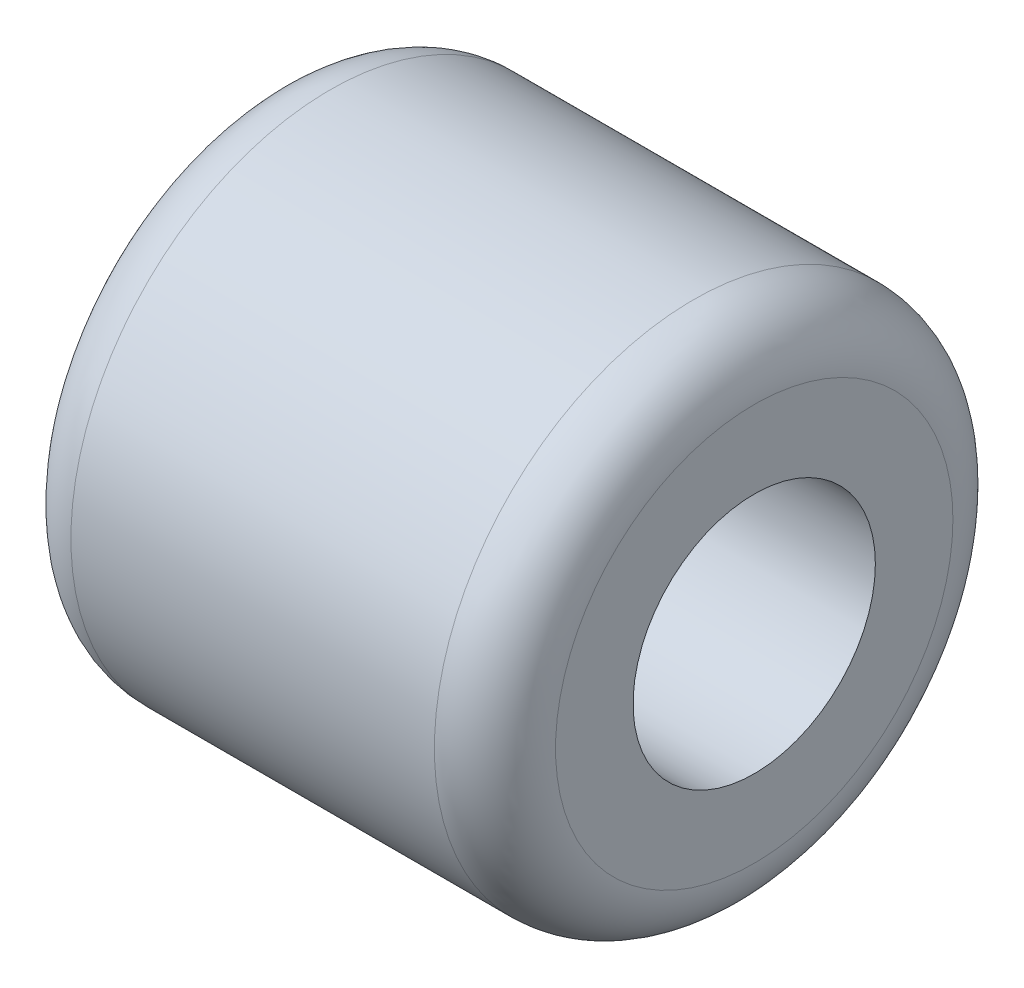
ISO-10303-21;
HEADER;
FILE_DESCRIPTION(('STEP AP214'),'2;1');
FILE_NAME('part.step','',(''),(''),'','','');
FILE_SCHEMA(('AUTOMOTIVE_DESIGN { 1 0 10303 214 1 1 1 1 }'));
ENDSEC;
DATA;
#1=APPLICATION_CONTEXT('core data for automotive mechanical design processes');
#2=APPLICATION_PROTOCOL_DEFINITION('international standard','automotive_design',2000,#1);
#3=PRODUCT_CONTEXT('',#1,'mechanical');
#4=PRODUCT('Part','Part','',(#3));
#5=PRODUCT_RELATED_PRODUCT_CATEGORY('part','',(#4));
#6=PRODUCT_DEFINITION_FORMATION('','',#4);
#7=PRODUCT_DEFINITION_CONTEXT('part definition',#1,'design');
#8=PRODUCT_DEFINITION('design','',#6,#7);
#9=PRODUCT_DEFINITION_SHAPE('','',#8);
#10=(LENGTH_UNIT() NAMED_UNIT(*) SI_UNIT(.MILLI.,.METRE.));
#11=(NAMED_UNIT(*) PLANE_ANGLE_UNIT() SI_UNIT($,.RADIAN.));
#12=(NAMED_UNIT(*) SI_UNIT($,.STERADIAN.) SOLID_ANGLE_UNIT());
#13=UNCERTAINTY_MEASURE_WITH_UNIT(LENGTH_MEASURE(1.E-05),#10,'distance_accuracy_value','');
#14=(GEOMETRIC_REPRESENTATION_CONTEXT(3) GLOBAL_UNCERTAINTY_ASSIGNED_CONTEXT((#13)) GLOBAL_UNIT_ASSIGNED_CONTEXT((#10,
#11,#12)) REPRESENTATION_CONTEXT('',''));
#15=CARTESIAN_POINT('',(0.,0.,0.));
#16=DIRECTION('',(0.,0.,1.));
#17=DIRECTION('',(1.,0.,0.));
#18=AXIS2_PLACEMENT_3D('',#15,#16,#17);
#19=CARTESIAN_POINT('',(5.08,0.,0.));
#20=DIRECTION('',(1.,0.,0.));
#21=DIRECTION('',(0.,0.,-1.));
#22=AXIS2_PLACEMENT_3D('',#19,#20,#21);
#23=PLANE('',#22);
#24=CARTESIAN_POINT('',(5.08,0.,0.));
#25=DIRECTION('',(1.,0.,0.));
#26=DIRECTION('',(0.,0.,-1.));
#27=AXIS2_PLACEMENT_3D('',#24,#25,#26);
#28=CIRCLE('',#27,4.1656);
#29=CARTESIAN_POINT('',(5.08,0.,-4.1656));
#30=VERTEX_POINT('',#29);
#31=EDGE_CURVE('E12',#30,#30,#28,.T.);
#32=ORIENTED_EDGE('',*,*,#31,.T.);
#33=EDGE_LOOP('',(#32));
#34=FACE_BOUND('',#33,.T.);
#35=CARTESIAN_POINT('',(5.08,0.,0.));
#36=DIRECTION('',(1.,0.,0.));
#37=DIRECTION('',(0.,0.,-1.));
#38=AXIS2_PLACEMENT_3D('',#35,#36,#37);
#39=CIRCLE('',#38,2.54);
#40=CARTESIAN_POINT('',(5.08,0.,-2.54));
#41=VERTEX_POINT('',#40);
#42=EDGE_CURVE('E60',#41,#41,#39,.T.);
#43=ORIENTED_EDGE('',*,*,#42,.F.);
#44=EDGE_LOOP('',(#43));
#45=FACE_BOUND('',#44,.T.);
#46=ADVANCED_FACE('F40',(#34,#45),#23,.T.);
#47=CARTESIAN_POINT('',(-5.08,0.,0.));
#48=DIRECTION('',(1.,0.,0.));
#49=DIRECTION('',(0.,0.,-1.));
#50=AXIS2_PLACEMENT_3D('',#47,#48,#49);
#51=PLANE('',#50);
#52=CARTESIAN_POINT('',(-5.08,0.,0.));
#53=DIRECTION('',(1.,0.,0.));
#54=DIRECTION('',(0.,0.,-1.));
#55=AXIS2_PLACEMENT_3D('',#52,#53,#54);
#56=CIRCLE('',#55,4.1656);
#57=CARTESIAN_POINT('',(-5.08,0.,-4.1656));
#58=VERTEX_POINT('',#57);
#59=EDGE_CURVE('E47',#58,#58,#56,.F.);
#60=ORIENTED_EDGE('',*,*,#59,.T.);
#61=EDGE_LOOP('',(#60));
#62=FACE_BOUND('',#61,.T.);
#63=CARTESIAN_POINT('',(-5.08,0.,0.));
#64=DIRECTION('',(1.,0.,0.));
#65=DIRECTION('',(0.,0.,-1.));
#66=AXIS2_PLACEMENT_3D('',#63,#64,#65);
#67=CIRCLE('',#66,2.54);
#68=CARTESIAN_POINT('',(-5.08,0.,-2.54));
#69=VERTEX_POINT('',#68);
#70=EDGE_CURVE('E63',#69,#69,#67,.T.);
#71=ORIENTED_EDGE('',*,*,#70,.T.);
#72=EDGE_LOOP('',(#71));
#73=FACE_BOUND('',#72,.T.);
#74=ADVANCED_FACE('F67',(#62,#73),#51,.F.);
#75=CARTESIAN_POINT('',(5.08,0.,0.));
#76=DIRECTION('',(-1.,0.,0.));
#77=DIRECTION('',(0.,0.,1.));
#78=AXIS2_PLACEMENT_3D('',#75,#76,#77);
#79=CYLINDRICAL_SURFACE('',#78,5.4356);
#80=CARTESIAN_POINT('',(-3.81,0.,0.));
#81=DIRECTION('',(1.,0.,0.));
#82=DIRECTION('',(0.,0.,-1.));
#83=AXIS2_PLACEMENT_3D('',#80,#81,#82);
#84=CIRCLE('',#83,5.4356);
#85=CARTESIAN_POINT('',(-3.81,0.,-5.4356));
#86=VERTEX_POINT('',#85);
#87=EDGE_CURVE('E51',#86,#86,#84,.T.);
#88=ORIENTED_EDGE('',*,*,#87,.T.);
#89=EDGE_LOOP('',(#88));
#90=FACE_BOUND('',#89,.T.);
#91=CARTESIAN_POINT('',(3.81,0.,0.));
#92=DIRECTION('',(1.,0.,0.));
#93=DIRECTION('',(0.,0.,-1.));
#94=AXIS2_PLACEMENT_3D('',#91,#92,#93);
#95=CIRCLE('',#94,5.4356);
#96=CARTESIAN_POINT('',(3.81,0.,-5.4356));
#97=VERTEX_POINT('',#96);
#98=EDGE_CURVE('E55',#97,#97,#95,.F.);
#99=ORIENTED_EDGE('',*,*,#98,.T.);
#100=EDGE_LOOP('',(#99));
#101=FACE_BOUND('',#100,.T.);
#102=ADVANCED_FACE('F42',(#90,#101),#79,.T.);
#103=CARTESIAN_POINT('',(5.08,0.,0.));
#104=DIRECTION('',(-1.,0.,0.));
#105=DIRECTION('',(0.,0.,1.));
#106=AXIS2_PLACEMENT_3D('',#103,#104,#105);
#107=CYLINDRICAL_SURFACE('',#106,2.54);
#108=ORIENTED_EDGE('',*,*,#42,.T.);
#109=EDGE_LOOP('',(#108));
#110=FACE_BOUND('',#109,.T.);
#111=ORIENTED_EDGE('',*,*,#70,.F.);
#112=EDGE_LOOP('',(#111));
#113=FACE_BOUND('',#112,.T.);
#114=ADVANCED_FACE('F69',(#110,#113),#107,.F.);
#115=CARTESIAN_POINT('',(-3.81,0.,0.));
#116=DIRECTION('',(1.,0.,0.));
#117=DIRECTION('',(0.,0.,-1.));
#118=AXIS2_PLACEMENT_3D('',#115,#116,#117);
#119=TOROIDAL_SURFACE('',#118,4.1656,1.27);
#120=ORIENTED_EDGE('',*,*,#59,.F.);
#121=EDGE_LOOP('',(#120));
#122=FACE_BOUND('',#121,.T.);
#123=ORIENTED_EDGE('',*,*,#87,.F.);
#124=EDGE_LOOP('',(#123));
#125=FACE_BOUND('',#124,.T.);
#126=ADVANCED_FACE('F71',(#122,#125),#119,.T.);
#127=CARTESIAN_POINT('',(3.81,0.,0.));
#128=DIRECTION('',(1.,0.,0.));
#129=DIRECTION('',(0.,0.,-1.));
#130=AXIS2_PLACEMENT_3D('',#127,#128,#129);
#131=TOROIDAL_SURFACE('',#130,4.1656,1.27);
#132=ORIENTED_EDGE('',*,*,#98,.F.);
#133=EDGE_LOOP('',(#132));
#134=FACE_BOUND('',#133,.T.);
#135=ORIENTED_EDGE('',*,*,#31,.F.);
#136=EDGE_LOOP('',(#135));
#137=FACE_BOUND('',#136,.T.);
#138=ADVANCED_FACE('F78',(#134,#137),#131,.T.);
#139=CLOSED_SHELL('',(#46,#74,#102,#114,#126,#138));
#140=MANIFOLD_SOLID_BREP('B2',#139);
#141=ADVANCED_BREP_SHAPE_REPRESENTATION('',(#18,#140),#14);
#142=SHAPE_DEFINITION_REPRESENTATION(#9,#141);
ENDSEC;
END-ISO-10303-21;
